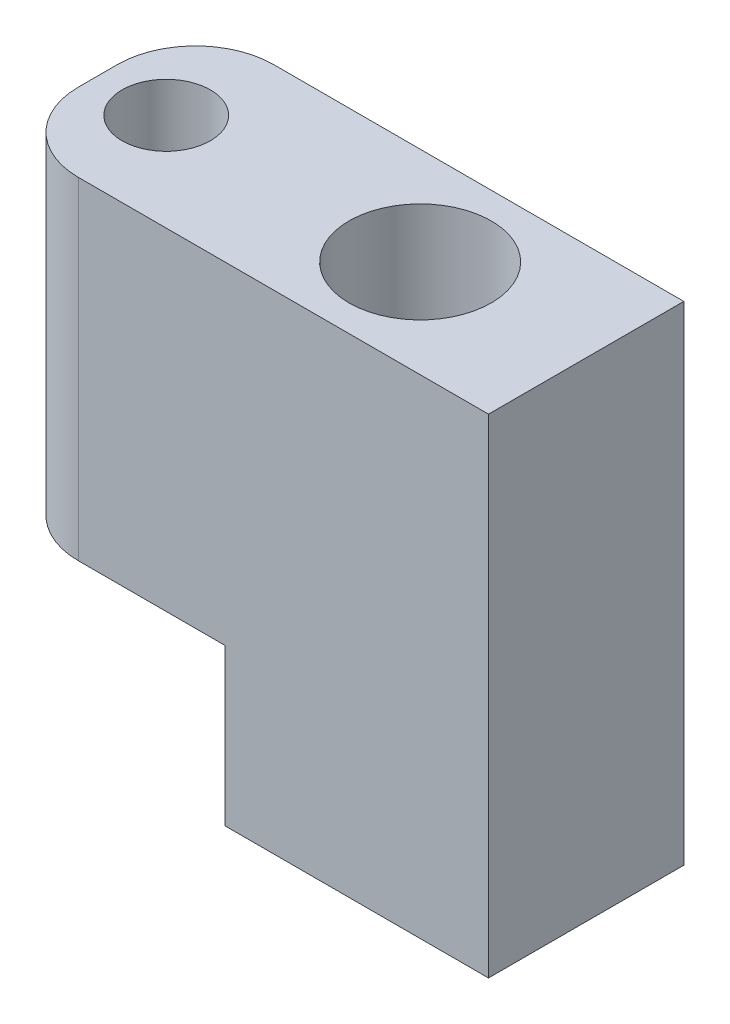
ISO-10303-21;
HEADER;
FILE_DESCRIPTION(('STEP AP214'),'2;1');
FILE_NAME('part.step','',(''),(''),'','','');
FILE_SCHEMA(('AUTOMOTIVE_DESIGN { 1 0 10303 214 1 1 1 1 }'));
ENDSEC;
DATA;
#1=APPLICATION_CONTEXT('core data for automotive mechanical design processes');
#2=APPLICATION_PROTOCOL_DEFINITION('international standard','automotive_design',2000,#1);
#3=PRODUCT_CONTEXT('',#1,'mechanical');
#4=PRODUCT('Part','Part','',(#3));
#5=PRODUCT_RELATED_PRODUCT_CATEGORY('part','',(#4));
#6=PRODUCT_DEFINITION_FORMATION('','',#4);
#7=PRODUCT_DEFINITION_CONTEXT('part definition',#1,'design');
#8=PRODUCT_DEFINITION('design','',#6,#7);
#9=PRODUCT_DEFINITION_SHAPE('','',#8);
#10=(LENGTH_UNIT() NAMED_UNIT(*) SI_UNIT(.MILLI.,.METRE.));
#11=(NAMED_UNIT(*) PLANE_ANGLE_UNIT() SI_UNIT($,.RADIAN.));
#12=(NAMED_UNIT(*) SI_UNIT($,.STERADIAN.) SOLID_ANGLE_UNIT());
#13=UNCERTAINTY_MEASURE_WITH_UNIT(LENGTH_MEASURE(1.E-05),#10,'distance_accuracy_value','');
#14=(GEOMETRIC_REPRESENTATION_CONTEXT(3) GLOBAL_UNCERTAINTY_ASSIGNED_CONTEXT((#13)) GLOBAL_UNIT_ASSIGNED_CONTEXT((#10,
#11,#12)) REPRESENTATION_CONTEXT('',''));
#15=CARTESIAN_POINT('',(0.,0.,0.));
#16=DIRECTION('',(0.,0.,1.));
#17=DIRECTION('',(1.,0.,0.));
#18=AXIS2_PLACEMENT_3D('',#15,#16,#17);
#19=CARTESIAN_POINT('',(17.4625,15.875,-3.175));
#20=DIRECTION('',(0.,0.,1.));
#21=DIRECTION('',(1.,0.,0.));
#22=AXIS2_PLACEMENT_3D('',#19,#20,#21);
#23=PLANE('',#22);
#24=DIRECTION('',(1.,0.,0.));
#25=VECTOR('',#24,1.);
#26=CARTESIAN_POINT('',(0.,5.08,-3.175));
#27=LINE('',#26,#25);
#28=CARTESIAN_POINT('',(17.4625,5.08,-3.175));
#29=VERTEX_POINT('',#28);
#30=CARTESIAN_POINT('',(22.225,5.08,-3.175));
#31=VERTEX_POINT('',#30);
#32=EDGE_CURVE('E167',#29,#31,#27,.T.);
#33=ORIENTED_EDGE('',*,*,#32,.F.);
#34=DIRECTION('',(0.,-1.,0.));
#35=VECTOR('',#34,1.);
#36=CARTESIAN_POINT('',(17.4625,15.875,-3.175));
#37=LINE('',#36,#35);
#38=CARTESIAN_POINT('',(17.4625,15.875,-3.175));
#39=VERTEX_POINT('',#38);
#40=EDGE_CURVE('E55',#39,#29,#37,.T.);
#41=ORIENTED_EDGE('',*,*,#40,.F.);
#42=DIRECTION('',(-1.,0.,0.));
#43=VECTOR('',#42,1.);
#44=CARTESIAN_POINT('',(17.4625,15.875,-3.175));
#45=LINE('',#44,#43);
#46=CARTESIAN_POINT('',(30.7975,15.875,-3.175));
#47=VERTEX_POINT('',#46);
#48=EDGE_CURVE('E94',#47,#39,#45,.T.);
#49=ORIENTED_EDGE('',*,*,#48,.F.);
#50=DIRECTION('',(0.,-1.,0.));
#51=VECTOR('',#50,1.);
#52=CARTESIAN_POINT('',(30.7975,15.875,-3.175));
#53=LINE('',#52,#51);
#54=CARTESIAN_POINT('',(30.7975,0.,-3.175));
#55=VERTEX_POINT('',#54);
#56=EDGE_CURVE('E11',#47,#55,#53,.T.);
#57=ORIENTED_EDGE('',*,*,#56,.T.);
#58=DIRECTION('',(-1.,0.,0.));
#59=VECTOR('',#58,1.);
#60=CARTESIAN_POINT('',(17.4625,0.,-3.175));
#61=LINE('',#60,#59);
#62=CARTESIAN_POINT('',(22.225,0.,-3.175));
#63=VERTEX_POINT('',#62);
#64=EDGE_CURVE('E142',#55,#63,#61,.T.);
#65=ORIENTED_EDGE('',*,*,#64,.T.);
#66=DIRECTION('',(0.,1.,0.));
#67=VECTOR('',#66,1.);
#68=CARTESIAN_POINT('',(22.225,0.,-3.175));
#69=LINE('',#68,#67);
#70=EDGE_CURVE('E62',#63,#31,#69,.T.);
#71=ORIENTED_EDGE('',*,*,#70,.T.);
#72=EDGE_LOOP('',(#33,#41,#49,#57,#65,#71));
#73=FACE_BOUND('',#72,.T.);
#74=ADVANCED_FACE('F45',(#73),#23,.F.);
#75=CARTESIAN_POINT('',(17.4625,15.875,-0.635));
#76=DIRECTION('',(0.,-1.,0.));
#77=DIRECTION('',(0.,0.,-1.));
#78=AXIS2_PLACEMENT_3D('',#75,#76,#77);
#79=CYLINDRICAL_SURFACE('',#78,2.54);
#80=CARTESIAN_POINT('',(17.4625,5.08,-0.635));
#81=DIRECTION('',(0.,-1.,0.));
#82=DIRECTION('',(0.,0.,-1.));
#83=AXIS2_PLACEMENT_3D('',#80,#81,#82);
#84=CIRCLE('',#83,2.54);
#85=CARTESIAN_POINT('',(14.9225,5.08,-0.635));
#86=VERTEX_POINT('',#85);
#87=EDGE_CURVE('E143',#86,#29,#84,.T.);
#88=ORIENTED_EDGE('',*,*,#87,.F.);
#89=DIRECTION('',(0.,-1.,0.));
#90=VECTOR('',#89,1.);
#91=CARTESIAN_POINT('',(14.9225,15.875,-0.635));
#92=LINE('',#91,#90);
#93=CARTESIAN_POINT('',(14.9225,15.875,-0.635));
#94=VERTEX_POINT('',#93);
#95=EDGE_CURVE('E126',#94,#86,#92,.T.);
#96=ORIENTED_EDGE('',*,*,#95,.F.);
#97=CARTESIAN_POINT('',(17.4625,15.875,-0.635));
#98=DIRECTION('',(0.,1.,0.));
#99=DIRECTION('',(0.,0.,1.));
#100=AXIS2_PLACEMENT_3D('',#97,#98,#99);
#101=CIRCLE('',#100,2.54);
#102=EDGE_CURVE('E110',#39,#94,#101,.T.);
#103=ORIENTED_EDGE('',*,*,#102,.F.);
#104=ORIENTED_EDGE('',*,*,#40,.T.);
#105=EDGE_LOOP('',(#88,#96,#103,#104));
#106=FACE_BOUND('',#105,.T.);
#107=ADVANCED_FACE('F161',(#106),#79,.T.);
#108=CARTESIAN_POINT('',(14.9225,15.875,-0.635));
#109=DIRECTION('',(1.,0.,0.));
#110=DIRECTION('',(0.,0.,-1.));
#111=AXIS2_PLACEMENT_3D('',#108,#109,#110);
#112=PLANE('',#111);
#113=DIRECTION('',(0.,0.,-1.));
#114=VECTOR('',#113,1.);
#115=CARTESIAN_POINT('',(14.9225,5.08,-0.635));
#116=LINE('',#115,#114);
#117=CARTESIAN_POINT('',(14.9225,5.08,0.634999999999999));
#118=VERTEX_POINT('',#117);
#119=EDGE_CURVE('E122',#118,#86,#116,.T.);
#120=ORIENTED_EDGE('',*,*,#119,.F.);
#121=DIRECTION('',(0.,-1.,0.));
#122=VECTOR('',#121,1.);
#123=CARTESIAN_POINT('',(14.9225,15.875,0.634999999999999));
#124=LINE('',#123,#122);
#125=CARTESIAN_POINT('',(14.9225,15.875,0.634999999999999));
#126=VERTEX_POINT('',#125);
#127=EDGE_CURVE('E118',#126,#118,#124,.T.);
#128=ORIENTED_EDGE('',*,*,#127,.F.);
#129=DIRECTION('',(0.,0.,1.));
#130=VECTOR('',#129,1.);
#131=CARTESIAN_POINT('',(14.9225,15.875,-0.635));
#132=LINE('',#131,#130);
#133=EDGE_CURVE('E103',#94,#126,#132,.T.);
#134=ORIENTED_EDGE('',*,*,#133,.F.);
#135=ORIENTED_EDGE('',*,*,#95,.T.);
#136=EDGE_LOOP('',(#120,#128,#134,#135));
#137=FACE_BOUND('',#136,.T.);
#138=ADVANCED_FACE('F119',(#137),#112,.F.);
#139=CARTESIAN_POINT('',(17.4625,15.875,0.634999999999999));
#140=DIRECTION('',(0.,-1.,0.));
#141=DIRECTION('',(0.,0.,-1.));
#142=AXIS2_PLACEMENT_3D('',#139,#140,#141);
#143=CYLINDRICAL_SURFACE('',#142,2.54);
#144=CARTESIAN_POINT('',(17.4625,5.08,0.634999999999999));
#145=DIRECTION('',(0.,-1.,0.));
#146=DIRECTION('',(0.,0.,-1.));
#147=AXIS2_PLACEMENT_3D('',#144,#145,#146);
#148=CIRCLE('',#147,2.54);
#149=CARTESIAN_POINT('',(17.4625,5.08,3.175));
#150=VERTEX_POINT('',#149);
#151=EDGE_CURVE('E193',#150,#118,#148,.T.);
#152=ORIENTED_EDGE('',*,*,#151,.F.);
#153=DIRECTION('',(0.,-1.,0.));
#154=VECTOR('',#153,1.);
#155=CARTESIAN_POINT('',(17.4625,15.875,3.175));
#156=LINE('',#155,#154);
#157=CARTESIAN_POINT('',(17.4625,15.875,3.175));
#158=VERTEX_POINT('',#157);
#159=EDGE_CURVE('E127',#158,#150,#156,.T.);
#160=ORIENTED_EDGE('',*,*,#159,.F.);
#161=CARTESIAN_POINT('',(17.4625,15.875,0.634999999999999));
#162=DIRECTION('',(0.,1.,0.));
#163=DIRECTION('',(0.,0.,1.));
#164=AXIS2_PLACEMENT_3D('',#161,#162,#163);
#165=CIRCLE('',#164,2.54);
#166=EDGE_CURVE('E107',#126,#158,#165,.T.);
#167=ORIENTED_EDGE('',*,*,#166,.F.);
#168=ORIENTED_EDGE('',*,*,#127,.T.);
#169=EDGE_LOOP('',(#152,#160,#167,#168));
#170=FACE_BOUND('',#169,.T.);
#171=ADVANCED_FACE('F129',(#170),#143,.T.);
#172=CARTESIAN_POINT('',(17.4625,15.875,3.175));
#173=DIRECTION('',(0.,0.,-1.));
#174=DIRECTION('',(-1.,0.,0.));
#175=AXIS2_PLACEMENT_3D('',#172,#173,#174);
#176=PLANE('',#175);
#177=DIRECTION('',(1.,0.,0.));
#178=VECTOR('',#177,1.);
#179=CARTESIAN_POINT('',(0.,5.08,3.175));
#180=LINE('',#179,#178);
#181=CARTESIAN_POINT('',(22.225,5.08,3.175));
#182=VERTEX_POINT('',#181);
#183=EDGE_CURVE('E179',#150,#182,#180,.T.);
#184=ORIENTED_EDGE('',*,*,#183,.T.);
#185=DIRECTION('',(0.,1.,0.));
#186=VECTOR('',#185,1.);
#187=CARTESIAN_POINT('',(22.225,0.,3.175));
#188=LINE('',#187,#186);
#189=CARTESIAN_POINT('',(22.225,0.,3.175));
#190=VERTEX_POINT('',#189);
#191=EDGE_CURVE('E172',#190,#182,#188,.T.);
#192=ORIENTED_EDGE('',*,*,#191,.F.);
#193=DIRECTION('',(1.,0.,0.));
#194=VECTOR('',#193,1.);
#195=CARTESIAN_POINT('',(17.4625,0.,3.175));
#196=LINE('',#195,#194);
#197=CARTESIAN_POINT('',(30.7975,0.,3.175));
#198=VERTEX_POINT('',#197);
#199=EDGE_CURVE('E86',#190,#198,#196,.T.);
#200=ORIENTED_EDGE('',*,*,#199,.T.);
#201=DIRECTION('',(0.,-1.,0.));
#202=VECTOR('',#201,1.);
#203=CARTESIAN_POINT('',(30.7975,15.875,3.175));
#204=LINE('',#203,#202);
#205=CARTESIAN_POINT('',(30.7975,15.875,3.175));
#206=VERTEX_POINT('',#205);
#207=EDGE_CURVE('E134',#206,#198,#204,.T.);
#208=ORIENTED_EDGE('',*,*,#207,.F.);
#209=DIRECTION('',(1.,0.,0.));
#210=VECTOR('',#209,1.);
#211=CARTESIAN_POINT('',(17.4625,15.875,3.175));
#212=LINE('',#211,#210);
#213=EDGE_CURVE('E71',#158,#206,#212,.T.);
#214=ORIENTED_EDGE('',*,*,#213,.F.);
#215=ORIENTED_EDGE('',*,*,#159,.T.);
#216=EDGE_LOOP('',(#184,#192,#200,#208,#214,#215));
#217=FACE_BOUND('',#216,.T.);
#218=ADVANCED_FACE('F215',(#217),#176,.F.);
#219=CARTESIAN_POINT('',(30.7975,15.875,-3.175));
#220=DIRECTION('',(-1.,0.,0.));
#221=DIRECTION('',(0.,0.,1.));
#222=AXIS2_PLACEMENT_3D('',#219,#220,#221);
#223=PLANE('',#222);
#224=DIRECTION('',(0.,0.,-1.));
#225=VECTOR('',#224,1.);
#226=CARTESIAN_POINT('',(30.7975,0.,-3.175));
#227=LINE('',#226,#225);
#228=EDGE_CURVE('E138',#198,#55,#227,.T.);
#229=ORIENTED_EDGE('',*,*,#228,.T.);
#230=ORIENTED_EDGE('',*,*,#56,.F.);
#231=DIRECTION('',(0.,0.,-1.));
#232=VECTOR('',#231,1.);
#233=CARTESIAN_POINT('',(30.7975,15.875,-3.175));
#234=LINE('',#233,#232);
#235=EDGE_CURVE('E149',#206,#47,#234,.T.);
#236=ORIENTED_EDGE('',*,*,#235,.F.);
#237=ORIENTED_EDGE('',*,*,#207,.T.);
#238=EDGE_LOOP('',(#229,#230,#236,#237));
#239=FACE_BOUND('',#238,.T.);
#240=ADVANCED_FACE('F47',(#239),#223,.F.);
#241=CARTESIAN_POINT('',(17.4625,15.875,0.634999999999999));
#242=DIRECTION('',(0.,1.,0.));
#243=DIRECTION('',(0.,0.,1.));
#244=AXIS2_PLACEMENT_3D('',#241,#242,#243);
#245=PLANE('',#244);
#246=CARTESIAN_POINT('',(17.145,15.875,0.));
#247=DIRECTION('',(0.,1.,0.));
#248=DIRECTION('',(0.,0.,1.));
#249=AXIS2_PLACEMENT_3D('',#246,#247,#248);
#250=CIRCLE('',#249,1.4351);
#251=CARTESIAN_POINT('',(17.145,15.875,1.4351));
#252=VERTEX_POINT('',#251);
#253=EDGE_CURVE('E253',#252,#252,#250,.T.);
#254=ORIENTED_EDGE('',*,*,#253,.F.);
#255=EDGE_LOOP('',(#254));
#256=FACE_BOUND('',#255,.T.);
#257=CARTESIAN_POINT('',(25.4,15.875,0.));
#258=DIRECTION('',(0.,1.,0.));
#259=DIRECTION('',(0.,0.,1.));
#260=AXIS2_PLACEMENT_3D('',#257,#258,#259);
#261=CIRCLE('',#260,2.31139999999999);
#262=CARTESIAN_POINT('',(25.4,15.875,2.31139999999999));
#263=VERTEX_POINT('',#262);
#264=EDGE_CURVE('E256',#263,#263,#261,.T.);
#265=ORIENTED_EDGE('',*,*,#264,.F.);
#266=EDGE_LOOP('',(#265));
#267=FACE_BOUND('',#266,.T.);
#268=ORIENTED_EDGE('',*,*,#235,.T.);
#269=ORIENTED_EDGE('',*,*,#48,.T.);
#270=ORIENTED_EDGE('',*,*,#102,.T.);
#271=ORIENTED_EDGE('',*,*,#133,.T.);
#272=ORIENTED_EDGE('',*,*,#166,.T.);
#273=ORIENTED_EDGE('',*,*,#213,.T.);
#274=EDGE_LOOP('',(#268,#269,#270,#271,#272,#273));
#275=FACE_BOUND('',#274,.T.);
#276=ADVANCED_FACE('F105',(#256,#267,#275),#245,.T.);
#277=CARTESIAN_POINT('',(17.4625,0.,0.634999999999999));
#278=DIRECTION('',(0.,1.,0.));
#279=DIRECTION('',(0.,0.,1.));
#280=AXIS2_PLACEMENT_3D('',#277,#278,#279);
#281=PLANE('',#280);
#282=CARTESIAN_POINT('',(25.4,0.,0.));
#283=DIRECTION('',(0.,1.,0.));
#284=DIRECTION('',(0.,0.,1.));
#285=AXIS2_PLACEMENT_3D('',#282,#283,#284);
#286=CIRCLE('',#285,2.3114);
#287=CARTESIAN_POINT('',(25.4,0.,2.3114));
#288=VERTEX_POINT('',#287);
#289=EDGE_CURVE('E182',#288,#288,#286,.T.);
#290=ORIENTED_EDGE('',*,*,#289,.T.);
#291=EDGE_LOOP('',(#290));
#292=FACE_BOUND('',#291,.T.);
#293=ORIENTED_EDGE('',*,*,#199,.F.);
#294=DIRECTION('',(0.,0.,1.));
#295=VECTOR('',#294,1.);
#296=CARTESIAN_POINT('',(22.225,0.,-3.175));
#297=LINE('',#296,#295);
#298=EDGE_CURVE('E176',#63,#190,#297,.T.);
#299=ORIENTED_EDGE('',*,*,#298,.F.);
#300=ORIENTED_EDGE('',*,*,#64,.F.);
#301=ORIENTED_EDGE('',*,*,#228,.F.);
#302=EDGE_LOOP('',(#293,#299,#300,#301));
#303=FACE_BOUND('',#302,.T.);
#304=ADVANCED_FACE('F210',(#292,#303),#281,.F.);
#305=CARTESIAN_POINT('',(0.,5.08,-3.175));
#306=DIRECTION('',(0.,-1.,0.));
#307=DIRECTION('',(0.,0.,-1.));
#308=AXIS2_PLACEMENT_3D('',#305,#306,#307);
#309=PLANE('',#308);
#310=CARTESIAN_POINT('',(17.145,5.08,0.));
#311=DIRECTION('',(0.,-1.,0.));
#312=DIRECTION('',(0.,0.,-1.));
#313=AXIS2_PLACEMENT_3D('',#310,#311,#312);
#314=CIRCLE('',#313,1.4351);
#315=CARTESIAN_POINT('',(17.145,5.08,-1.4351));
#316=VERTEX_POINT('',#315);
#317=EDGE_CURVE('E49',#316,#316,#314,.T.);
#318=ORIENTED_EDGE('',*,*,#317,.F.);
#319=EDGE_LOOP('',(#318));
#320=FACE_BOUND('',#319,.T.);
#321=ORIENTED_EDGE('',*,*,#87,.T.);
#322=ORIENTED_EDGE('',*,*,#32,.T.);
#323=DIRECTION('',(0.,0.,1.));
#324=VECTOR('',#323,1.);
#325=CARTESIAN_POINT('',(22.225,5.08,-3.175));
#326=LINE('',#325,#324);
#327=EDGE_CURVE('E190',#31,#182,#326,.T.);
#328=ORIENTED_EDGE('',*,*,#327,.T.);
#329=ORIENTED_EDGE('',*,*,#183,.F.);
#330=ORIENTED_EDGE('',*,*,#151,.T.);
#331=ORIENTED_EDGE('',*,*,#119,.T.);
#332=EDGE_LOOP('',(#321,#322,#328,#329,#330,#331));
#333=FACE_BOUND('',#332,.T.);
#334=ADVANCED_FACE('F218',(#320,#333),#309,.T.);
#335=CARTESIAN_POINT('',(22.225,0.,-3.175));
#336=DIRECTION('',(1.,0.,0.));
#337=DIRECTION('',(0.,0.,-1.));
#338=AXIS2_PLACEMENT_3D('',#335,#336,#337);
#339=PLANE('',#338);
#340=ORIENTED_EDGE('',*,*,#191,.T.);
#341=ORIENTED_EDGE('',*,*,#327,.F.);
#342=ORIENTED_EDGE('',*,*,#70,.F.);
#343=ORIENTED_EDGE('',*,*,#298,.T.);
#344=EDGE_LOOP('',(#340,#341,#342,#343));
#345=FACE_BOUND('',#344,.T.);
#346=ADVANCED_FACE('F212',(#345),#339,.F.);
#347=CARTESIAN_POINT('',(25.4,15.875,0.));
#348=DIRECTION('',(0.,1.,0.));
#349=DIRECTION('',(0.,0.,1.));
#350=AXIS2_PLACEMENT_3D('',#347,#348,#349);
#351=CYLINDRICAL_SURFACE('',#350,2.31139999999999);
#352=ORIENTED_EDGE('',*,*,#289,.F.);
#353=EDGE_LOOP('',(#352));
#354=FACE_BOUND('',#353,.T.);
#355=ORIENTED_EDGE('',*,*,#264,.T.);
#356=EDGE_LOOP('',(#355));
#357=FACE_BOUND('',#356,.T.);
#358=ADVANCED_FACE('F228',(#354,#357),#351,.F.);
#359=CARTESIAN_POINT('',(17.145,15.875,0.));
#360=DIRECTION('',(0.,1.,0.));
#361=DIRECTION('',(0.,0.,1.));
#362=AXIS2_PLACEMENT_3D('',#359,#360,#361);
#363=CYLINDRICAL_SURFACE('',#362,1.4351);
#364=ORIENTED_EDGE('',*,*,#317,.T.);
#365=EDGE_LOOP('',(#364));
#366=FACE_BOUND('',#365,.T.);
#367=ORIENTED_EDGE('',*,*,#253,.T.);
#368=EDGE_LOOP('',(#367));
#369=FACE_BOUND('',#368,.T.);
#370=ADVANCED_FACE('F266',(#366,#369),#363,.F.);
#371=CLOSED_SHELL('',(#74,#107,#138,#171,#218,#240,#276,#304,#334,#346,#358,#370));
#372=MANIFOLD_SOLID_BREP('B2',#371);
#373=ADVANCED_BREP_SHAPE_REPRESENTATION('',(#18,#372),#14);
#374=SHAPE_DEFINITION_REPRESENTATION(#9,#373);
ENDSEC;
END-ISO-10303-21;
